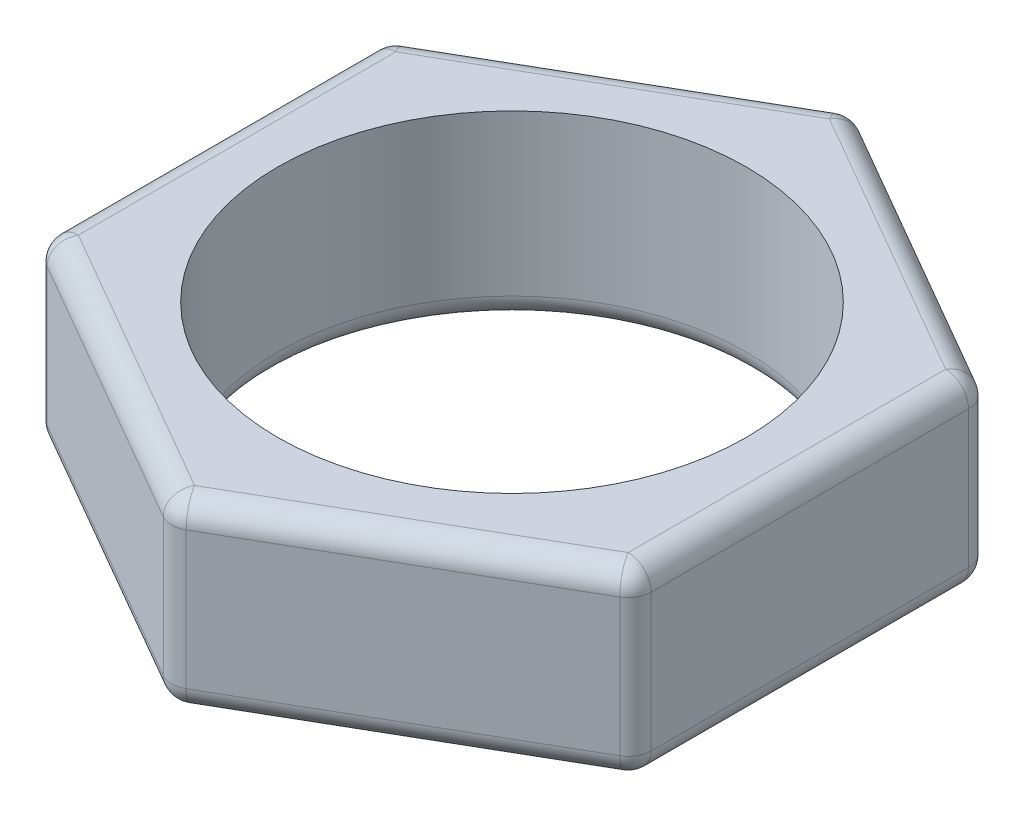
from build123d import *

# Parameters (mm, degrees)
SZKIC1_R                    = 5.113501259
DODANIE_WYCI_GNI_CIE1_DEPTH = 4
ZAOKR_GLENIE1_R             = 0.5


with BuildPart() as part:
    # Szkic1 → Dodanie-wyci_gni_cie1 (new body)
    with BuildSketch(Plane(origin=(0, 0, 0), x_dir=(1, 0, 0), z_dir=(0, 1, 0))):
        Polygon((0, -7.505553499), (6.5, -3.75277675), (6.5, 3.75277675), (0, 7.505553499), (-6.5, 3.75277675), (-6.5, -3.75277675), align=None)
        with Locations(Location((0, 0, 0), (0, 0, 270))):
            Circle(SZKIC1_R, mode=Mode.SUBTRACT)
    extrude(amount=DODANIE_WYCI_GNI_CIE1_DEPTH)

    # Zaokr_glenie1
    zaokr_glenie1_edges = [part.edges().sort_by_distance(p)[0] for p in [
        (6.5, 4, 0),
        (-6.5, 2, 3.75277675),
        (-6.5, 2, -3.75277675),
        (0, 2, -7.505553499),
        (6.5, 2, -3.75277675),
        (6.5, 2, 3.75277675),
        (0, 2, 7.505553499),
        (3.25, 4, -5.629165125),
        (-3.25, 4, -5.629165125),
        (0, 0, -5.113501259),
        (-6.5, 4, 0),
        (-3.25, 4, 5.629165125),
        (-6.5, 0, 0),
        (-3.25, 0, -5.629165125),
        (3.25, 0, -5.629165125),
        (3.25, 4, 5.629165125),
        (6.5, 0, 0),
        (3.25, 0, 5.629165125),
        (-3.25, 0, 5.629165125),
    ]]
    fillet(zaokr_glenie1_edges, radius=ZAOKR_GLENIE1_R)


solid = part.part
